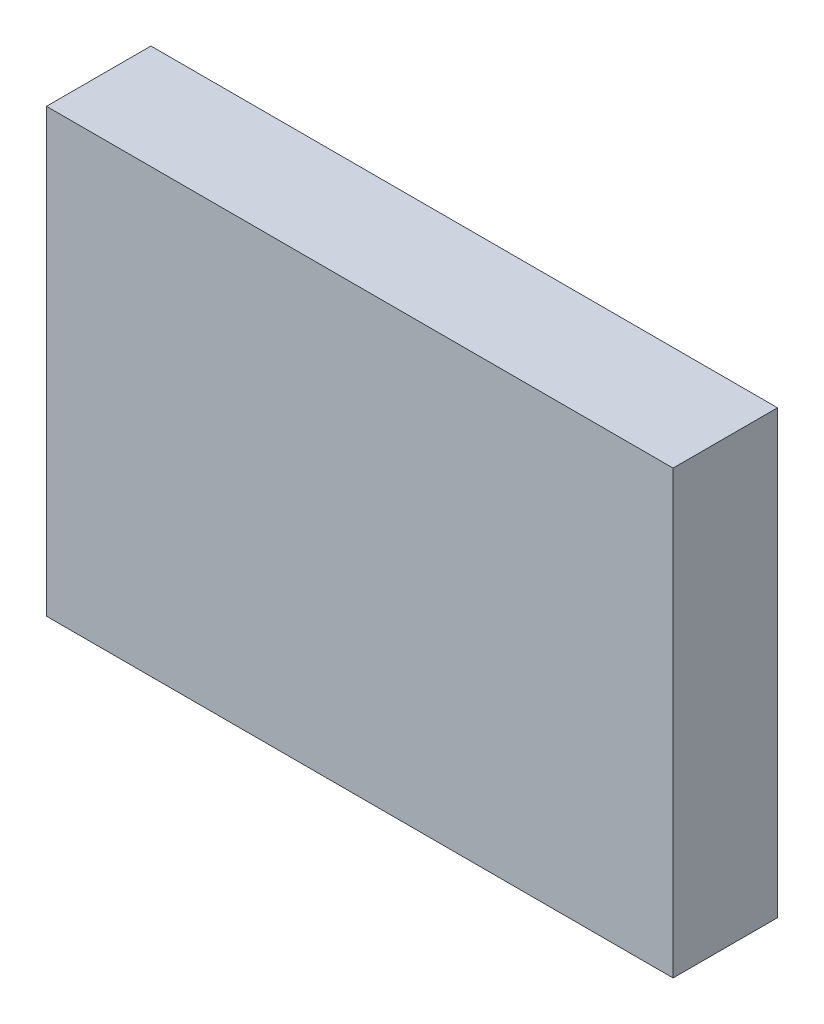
from build123d import *

# Parameters (mm, degrees)
ESQUISSE1_W        = 210
ESQUISSE1_H        = 148
BOSS_EXTRU_1_DEPTH = 35


with BuildPart() as part:
    # Esquisse1 → Boss.-Extru.1 (new body)
    with BuildSketch(Plane.XY):
        with Locations((105, 74)):
            Rectangle(ESQUISSE1_W, ESQUISSE1_H)
    extrude(amount=BOSS_EXTRU_1_DEPTH)


solid = part.part
